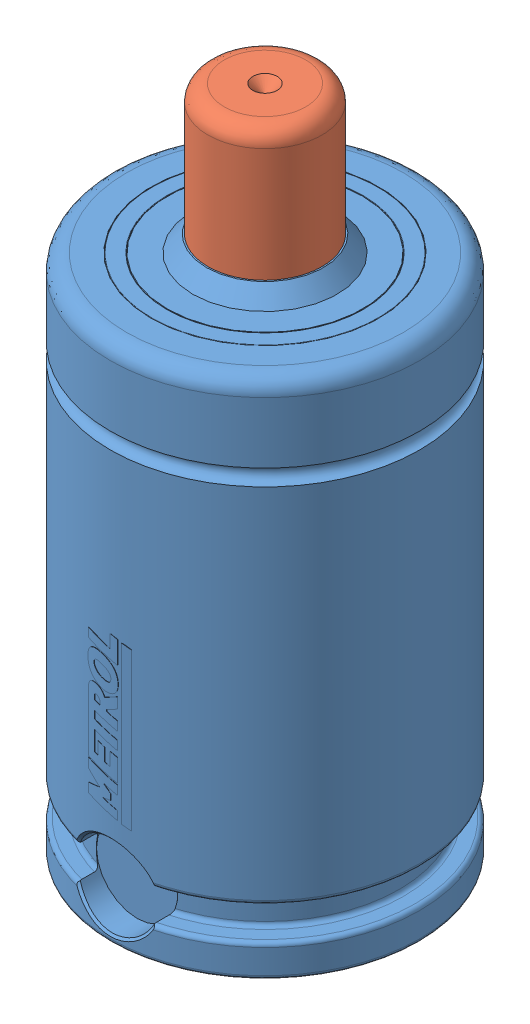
SolidWorks assembly ISNG0250-016.SLDASM, configuration Default (file format 7000). Lengths in mm.
Overall size (38 82 38.1).
2 component instances, 2 part files, 6 mates.
Components (placement in the parent):
- ISNG0250 BODY-1: ISNG0250 BODY.SLDPRT [ISNG0250-016] x (0 0 1) z (0 -1 0) size (38.1 38 66)
- ISNG0250 PISTON-1: ISNG0250 PISTON.SLDPRT [ISNG0250-016] at (0 41 0) x (-1 0 0) z (0 1 0) size (24 24 41)
Mates (geometry in assembly coordinates):
- Concentric1: concentric aligned: cylinder of ISNG0250 BODY-1 through (0 0 0) axis (0 -1 0) radius 7; cylinder of ISNG0250 PISTON-1 through (0 41 0) axis (0 -1 0) radius 7
- LimitDistance1: limit distance anti-aligned: plane of ISNG0250 BODY-1 through (-7 46 0) normal (0 -1 0); plane of ISNG0250 PISTON-1 through (0 46 12) normal (0 1 0)
- Coincident1: coincident anti-aligned: plane of ISNG0250 BODY-1 through (-19 0 0) normal (0 -1 0); plane of assembly through (0 0 0) normal (0 1 0)
- Coincident3: coincident anti-aligned: plane of ISNG0250 BODY-1; plane of assembly through (0 0 0) normal (1 0 0)
- Coincident4: coincident aligned: plane of ISNG0250 BODY-1; plane of assembly through (0 0 0) normal (0 0 1)
- Coincident5: coincident aligned: plane of ISNG0250 PISTON-1; plane of assembly through (0 0 0) normal (0 0 1)
